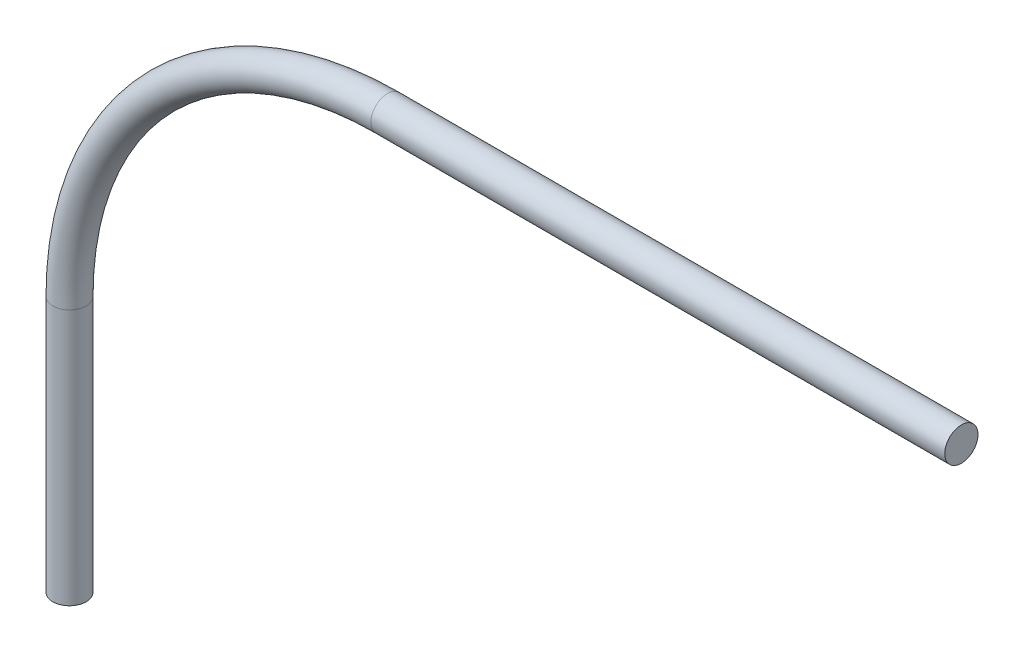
from build123d import *

# Parameters (mm, degrees)
SKETCH2_R = 3.81


with BuildPart() as part:
    # Sweep1: sweep along a path in Sketch1
    with BuildLine(Plane.XY) as sweep1_path:
        Line((-57.15, 38.1), (-57.15, 96.769105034))
        ThreePointArc((-57.15, 96.769105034), (-35.824657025, 148.253037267), (15.659275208, 169.578380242))
        Line((15.659275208, 169.578380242), (147.058088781, 169.578380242))
    # Sketch2 → Sweep1 (sweep)
    with BuildSketch(Plane(origin=(0, 38.1, 0), x_dir=(1, 0, 0), z_dir=(0, 1, 0))):
        with Locations((-57.15, 0)):
            Circle(SKETCH2_R)
    sweep(path=sweep1_path.line)


solid = part.part
